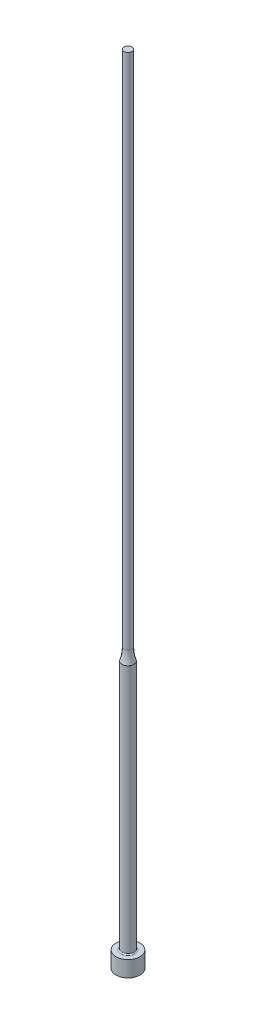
ISO-10303-21;
HEADER;
FILE_DESCRIPTION(('STEP AP214'),'2;1');
FILE_NAME('part.step','',(''),(''),'','','');
FILE_SCHEMA(('AUTOMOTIVE_DESIGN { 1 0 10303 214 1 1 1 1 }'));
ENDSEC;
DATA;
#1=APPLICATION_CONTEXT('core data for automotive mechanical design processes');
#2=APPLICATION_PROTOCOL_DEFINITION('international standard','automotive_design',2000,#1);
#3=PRODUCT_CONTEXT('',#1,'mechanical');
#4=PRODUCT('Part','Part','',(#3));
#5=PRODUCT_RELATED_PRODUCT_CATEGORY('part','',(#4));
#6=PRODUCT_DEFINITION_FORMATION('','',#4);
#7=PRODUCT_DEFINITION_CONTEXT('part definition',#1,'design');
#8=PRODUCT_DEFINITION('design','',#6,#7);
#9=PRODUCT_DEFINITION_SHAPE('','',#8);
#10=(LENGTH_UNIT() NAMED_UNIT(*) SI_UNIT(.MILLI.,.METRE.));
#11=(NAMED_UNIT(*) PLANE_ANGLE_UNIT() SI_UNIT($,.RADIAN.));
#12=(NAMED_UNIT(*) SI_UNIT($,.STERADIAN.) SOLID_ANGLE_UNIT());
#13=UNCERTAINTY_MEASURE_WITH_UNIT(LENGTH_MEASURE(1.E-05),#10,'distance_accuracy_value','');
#14=(GEOMETRIC_REPRESENTATION_CONTEXT(3) GLOBAL_UNCERTAINTY_ASSIGNED_CONTEXT((#13)) GLOBAL_UNIT_ASSIGNED_CONTEXT((#10,
#11,#12)) REPRESENTATION_CONTEXT('',''));
#15=CARTESIAN_POINT('',(0.,0.,0.));
#16=DIRECTION('',(0.,0.,1.));
#17=DIRECTION('',(1.,0.,0.));
#18=AXIS2_PLACEMENT_3D('',#15,#16,#17);
#19=CARTESIAN_POINT('',(1.00000000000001,200.,0.));
#20=DIRECTION('',(0.,-1.,0.));
#21=DIRECTION('',(1.,0.,0.));
#22=AXIS2_PLACEMENT_3D('',#19,#20,#21);
#23=PLANE('',#22);
#24=CARTESIAN_POINT('',(0.,200.,0.));
#25=DIRECTION('',(0.,1.,0.));
#26=DIRECTION('',(-1.,0.,0.));
#27=AXIS2_PLACEMENT_3D('',#24,#25,#26);
#28=CIRCLE('',#27,1.00000000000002);
#29=CARTESIAN_POINT('',(-1.00000000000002,200.,0.));
#30=VERTEX_POINT('',#29);
#31=EDGE_CURVE('E10',#30,#30,#28,.T.);
#32=ORIENTED_EDGE('',*,*,#31,.T.);
#33=EDGE_LOOP('',(#32));
#34=FACE_BOUND('',#33,.T.);
#35=ADVANCED_FACE('F30',(#34),#23,.F.);
#36=CARTESIAN_POINT('',(0.,200.,0.));
#37=DIRECTION('',(0.,1.,0.));
#38=DIRECTION('',(-1.,0.,0.));
#39=AXIS2_PLACEMENT_3D('',#36,#37,#38);
#40=CYLINDRICAL_SURFACE('',#39,1.00000000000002);
#41=ORIENTED_EDGE('',*,*,#31,.F.);
#42=EDGE_LOOP('',(#41));
#43=FACE_BOUND('',#42,.T.);
#44=CARTESIAN_POINT('',(0.,70.,0.));
#45=DIRECTION('',(0.,1.,0.));
#46=DIRECTION('',(-1.,0.,0.));
#47=AXIS2_PLACEMENT_3D('',#44,#45,#46);
#48=CIRCLE('',#47,1.00000000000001);
#49=CARTESIAN_POINT('',(-1.00000000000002,70.,0.));
#50=VERTEX_POINT('',#49);
#51=EDGE_CURVE('E36',#50,#50,#48,.T.);
#52=ORIENTED_EDGE('',*,*,#51,.T.);
#53=EDGE_LOOP('',(#52));
#54=FACE_BOUND('',#53,.T.);
#55=ADVANCED_FACE('F71',(#43,#54),#40,.T.);
#56=CARTESIAN_POINT('',(0.,70.,0.));
#57=DIRECTION('',(0.,1.,0.));
#58=DIRECTION('',(-1.,0.,0.));
#59=AXIS2_PLACEMENT_3D('',#56,#57,#58);
#60=TOROIDAL_SURFACE('',#59,11.,10.);
#61=ORIENTED_EDGE('',*,*,#51,.F.);
#62=EDGE_LOOP('',(#61));
#63=FACE_BOUND('',#62,.T.);
#64=CARTESIAN_POINT('',(0.,66.8775010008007,0.));
#65=DIRECTION('',(0.,1.,0.));
#66=DIRECTION('',(-1.,0.,0.));
#67=AXIS2_PLACEMENT_3D('',#64,#65,#66);
#68=CIRCLE('',#67,1.50000000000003);
#69=CARTESIAN_POINT('',(-1.50000000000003,66.8775010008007,0.));
#70=VERTEX_POINT('',#69);
#71=EDGE_CURVE('E40',#70,#70,#68,.T.);
#72=ORIENTED_EDGE('',*,*,#71,.T.);
#73=EDGE_LOOP('',(#72));
#74=FACE_BOUND('',#73,.T.);
#75=ADVANCED_FACE('F75',(#63,#74),#60,.F.);
#76=CARTESIAN_POINT('',(0.,200.,0.));
#77=DIRECTION('',(0.,1.,0.));
#78=DIRECTION('',(-1.,0.,0.));
#79=AXIS2_PLACEMENT_3D('',#76,#77,#78);
#80=CYLINDRICAL_SURFACE('',#79,1.50000000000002);
#81=ORIENTED_EDGE('',*,*,#71,.F.);
#82=EDGE_LOOP('',(#81));
#83=FACE_BOUND('',#82,.T.);
#84=CARTESIAN_POINT('',(0.,4.3,0.));
#85=DIRECTION('',(0.,1.,0.));
#86=DIRECTION('',(-1.,0.,0.));
#87=AXIS2_PLACEMENT_3D('',#84,#85,#86);
#88=CIRCLE('',#87,1.50000000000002);
#89=CARTESIAN_POINT('',(-1.50000000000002,4.3,0.));
#90=VERTEX_POINT('',#89);
#91=EDGE_CURVE('E44',#90,#90,#88,.T.);
#92=ORIENTED_EDGE('',*,*,#91,.T.);
#93=EDGE_LOOP('',(#92));
#94=FACE_BOUND('',#93,.T.);
#95=ADVANCED_FACE('F80',(#83,#94),#80,.T.);
#96=CARTESIAN_POINT('',(0.,4.3,0.));
#97=DIRECTION('',(0.,1.,0.));
#98=DIRECTION('',(-1.,0.,0.));
#99=AXIS2_PLACEMENT_3D('',#96,#97,#98);
#100=TOROIDAL_SURFACE('',#99,1.80000000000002,0.3);
#101=ORIENTED_EDGE('',*,*,#91,.F.);
#102=EDGE_LOOP('',(#101));
#103=FACE_BOUND('',#102,.T.);
#104=CARTESIAN_POINT('',(0.,4.,0.));
#105=DIRECTION('',(0.,1.,0.));
#106=DIRECTION('',(-1.,0.,0.));
#107=AXIS2_PLACEMENT_3D('',#104,#105,#106);
#108=CIRCLE('',#107,1.80000000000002);
#109=CARTESIAN_POINT('',(-1.80000000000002,4.,0.));
#110=VERTEX_POINT('',#109);
#111=EDGE_CURVE('E49',#110,#110,#108,.T.);
#112=ORIENTED_EDGE('',*,*,#111,.T.);
#113=EDGE_LOOP('',(#112));
#114=FACE_BOUND('',#113,.T.);
#115=ADVANCED_FACE('F86',(#103,#114),#100,.F.);
#116=CARTESIAN_POINT('',(3.00000000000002,4.,0.));
#117=DIRECTION('',(0.,-1.,0.));
#118=DIRECTION('',(1.,0.,0.));
#119=AXIS2_PLACEMENT_3D('',#116,#117,#118);
#120=PLANE('',#119);
#121=ORIENTED_EDGE('',*,*,#111,.F.);
#122=EDGE_LOOP('',(#121));
#123=FACE_BOUND('',#122,.T.);
#124=CARTESIAN_POINT('',(0.,4.,0.));
#125=DIRECTION('',(0.,1.,0.));
#126=DIRECTION('',(-1.,0.,0.));
#127=AXIS2_PLACEMENT_3D('',#124,#125,#126);
#128=CIRCLE('',#127,3.00000000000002);
#129=CARTESIAN_POINT('',(-3.00000000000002,4.,0.));
#130=VERTEX_POINT('',#129);
#131=EDGE_CURVE('E52',#130,#130,#128,.T.);
#132=ORIENTED_EDGE('',*,*,#131,.T.);
#133=EDGE_LOOP('',(#132));
#134=FACE_BOUND('',#133,.T.);
#135=ADVANCED_FACE('F67',(#123,#134),#120,.F.);
#136=CARTESIAN_POINT('',(0.,200.,0.));
#137=DIRECTION('',(0.,1.,0.));
#138=DIRECTION('',(-1.,0.,0.));
#139=AXIS2_PLACEMENT_3D('',#136,#137,#138);
#140=CYLINDRICAL_SURFACE('',#139,3.00000000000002);
#141=ORIENTED_EDGE('',*,*,#131,.F.);
#142=EDGE_LOOP('',(#141));
#143=FACE_BOUND('',#142,.T.);
#144=CARTESIAN_POINT('',(0.,0.,0.));
#145=DIRECTION('',(0.,1.,0.));
#146=DIRECTION('',(-1.,0.,0.));
#147=AXIS2_PLACEMENT_3D('',#144,#145,#146);
#148=CIRCLE('',#147,3.00000000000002);
#149=CARTESIAN_POINT('',(-3.00000000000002,0.,0.));
#150=VERTEX_POINT('',#149);
#151=EDGE_CURVE('E55',#150,#150,#148,.T.);
#152=ORIENTED_EDGE('',*,*,#151,.T.);
#153=EDGE_LOOP('',(#152));
#154=FACE_BOUND('',#153,.T.);
#155=ADVANCED_FACE('F59',(#143,#154),#140,.T.);
#156=CARTESIAN_POINT('',(0.,0.,0.));
#157=DIRECTION('',(0.,1.,0.));
#158=DIRECTION('',(-1.,0.,0.));
#159=AXIS2_PLACEMENT_3D('',#156,#157,#158);
#160=PLANE('',#159);
#161=ORIENTED_EDGE('',*,*,#151,.F.);
#162=EDGE_LOOP('',(#161));
#163=FACE_BOUND('',#162,.T.);
#164=ADVANCED_FACE('F61',(#163),#160,.F.);
#165=CLOSED_SHELL('',(#35,#55,#75,#95,#115,#135,#155,#164));
#166=MANIFOLD_SOLID_BREP('B2',#165);
#167=ADVANCED_BREP_SHAPE_REPRESENTATION('',(#18,#166),#14);
#168=SHAPE_DEFINITION_REPRESENTATION(#9,#167);
ENDSEC;
END-ISO-10303-21;
